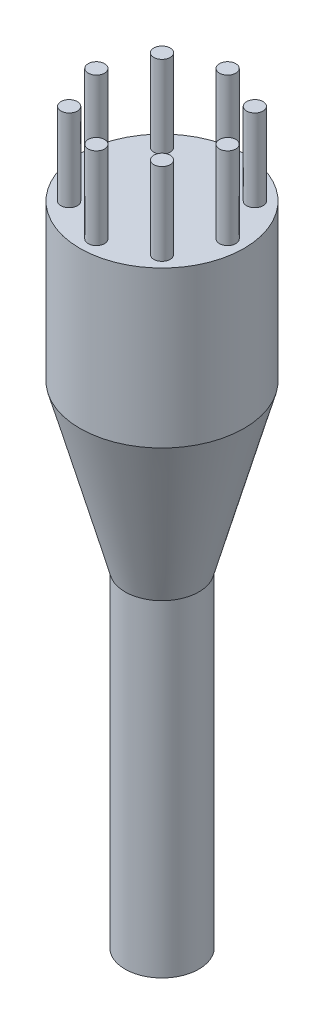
from build123d import *

# Parameters (mm, degrees)
SKETCH2_R         = 10
EXTRUDE1_DEPTH    = 19
SKETCH5_R         = 1
EXTRUDE4_DEPTH    = 10
CIRPATTERN1_COUNT = 8


with BuildPart() as part:
    # Sketch2 → Extrude1 (new body)
    with BuildSketch(Plane(origin=(0, 0, 0), x_dir=(1, 0, 0), z_dir=(0, 1, 0))):
        with Locations(Location((0, 0, 0), (0, 0, 270))):
            Circle(SKETCH2_R)
    extrude(amount=EXTRUDE1_DEPTH)

    # Sketch5 → Extrude4 (add)
    with BuildSketch(Plane(origin=(0, 19, 0), x_dir=(-1, 0, 0), z_dir=(0, 1, 0))):
        with Locations(Location((0, -8, 0), (0, 0, 90))):
            Circle(SKETCH5_R)
    extrude4 = extrude(amount=EXTRUDE4_DEPTH)

    # CirPattern1: Extrude4 ×8 about axis
    cirpattern1_axis = Axis((0, 0, 0), (0, 1, 0))
    for i in range(1, CIRPATTERN1_COUNT):
        add(extrude4.rotate(cirpattern1_axis, i * 360 / CIRPATTERN1_COUNT))

    # Sketch7 → Revolve1 (revolve)
    with BuildSketch(Plane(origin=(0, 0, 0), x_dir=(0, 0, -1), z_dir=(1, 0, 0))):
        Polygon((-10, 0), (-4.5, -20), (-4.5, -59.816846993), (0, -59.816846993), (0, 0), align=None)
    revolve(axis=Axis((0, 73.49787234, 0), (0, -1, 0)))


solid = part.part
